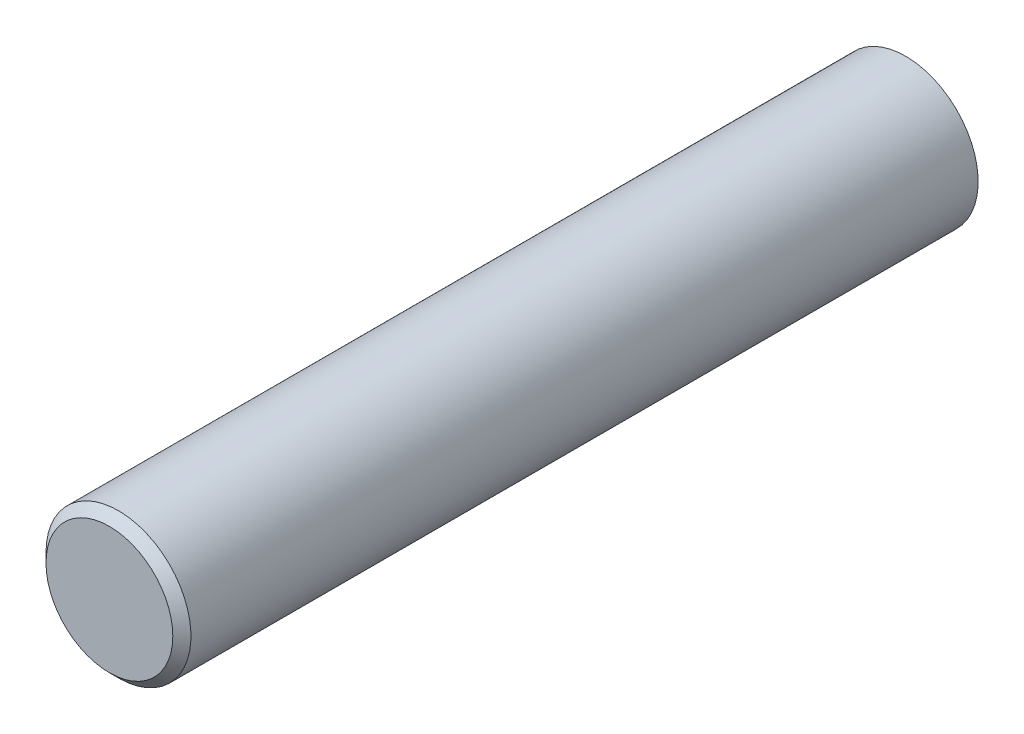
ISO-10303-21;
HEADER;
FILE_DESCRIPTION(('STEP AP214'),'2;1');
FILE_NAME('part.step','',(''),(''),'','','');
FILE_SCHEMA(('AUTOMOTIVE_DESIGN { 1 0 10303 214 1 1 1 1 }'));
ENDSEC;
DATA;
#1=APPLICATION_CONTEXT('core data for automotive mechanical design processes');
#2=APPLICATION_PROTOCOL_DEFINITION('international standard','automotive_design',2000,#1);
#3=PRODUCT_CONTEXT('',#1,'mechanical');
#4=PRODUCT('Part','Part','',(#3));
#5=PRODUCT_RELATED_PRODUCT_CATEGORY('part','',(#4));
#6=PRODUCT_DEFINITION_FORMATION('','',#4);
#7=PRODUCT_DEFINITION_CONTEXT('part definition',#1,'design');
#8=PRODUCT_DEFINITION('design','',#6,#7);
#9=PRODUCT_DEFINITION_SHAPE('','',#8);
#10=(LENGTH_UNIT() NAMED_UNIT(*) SI_UNIT(.MILLI.,.METRE.));
#11=(NAMED_UNIT(*) PLANE_ANGLE_UNIT() SI_UNIT($,.RADIAN.));
#12=(NAMED_UNIT(*) SI_UNIT($,.STERADIAN.) SOLID_ANGLE_UNIT());
#13=UNCERTAINTY_MEASURE_WITH_UNIT(LENGTH_MEASURE(1.E-05),#10,'distance_accuracy_value','');
#14=(GEOMETRIC_REPRESENTATION_CONTEXT(3) GLOBAL_UNCERTAINTY_ASSIGNED_CONTEXT((#13)) GLOBAL_UNIT_ASSIGNED_CONTEXT((#10,
#11,#12)) REPRESENTATION_CONTEXT('',''));
#15=CARTESIAN_POINT('',(0.,0.,0.));
#16=DIRECTION('',(0.,0.,1.));
#17=DIRECTION('',(1.,0.,0.));
#18=AXIS2_PLACEMENT_3D('',#15,#16,#17);
#19=CARTESIAN_POINT('',(0.,0.,90.));
#20=DIRECTION('',(0.,0.,-1.));
#21=DIRECTION('',(-1.,0.,0.));
#22=AXIS2_PLACEMENT_3D('',#19,#20,#21);
#23=CYLINDRICAL_SURFACE('',#22,8.);
#24=CARTESIAN_POINT('',(0.,0.,89.));
#25=DIRECTION('',(0.,0.,1.));
#26=DIRECTION('',(1.,0.,0.));
#27=AXIS2_PLACEMENT_3D('',#24,#25,#26);
#28=CIRCLE('',#27,8.);
#29=CARTESIAN_POINT('',(-8.,0.,89.));
#30=VERTEX_POINT('',#29);
#31=EDGE_CURVE('E10',#30,#30,#28,.F.);
#32=CARTESIAN_POINT('',(0.,0.,2.08633764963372));
#33=DIRECTION('',(0.,0.,-1.));
#34=DIRECTION('',(-1.,0.,0.));
#35=AXIS2_PLACEMENT_3D('',#32,#33,#34);
#36=CIRCLE('',#35,8.);
#37=CARTESIAN_POINT('',(-8.,0.,2.08633764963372));
#38=VERTEX_POINT('',#37);
#39=EDGE_CURVE('E42',#38,#38,#36,.T.);
#40=CARTESIAN_POINT('',(-8.,0.,89.));
#41=CARTESIAN_POINT('',(-8.,0.,88.094649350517));
#42=CARTESIAN_POINT('',(-8.,0.,87.189298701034));
#43=CARTESIAN_POINT('',(-8.,0.,85.3785974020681));
#44=CARTESIAN_POINT('',(-8.,0.,84.4732467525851));
#45=CARTESIAN_POINT('',(-8.,0.,82.6625454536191));
#46=CARTESIAN_POINT('',(-8.,0.,81.7571948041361));
#47=CARTESIAN_POINT('',(-8.,0.,79.9464935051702));
#48=CARTESIAN_POINT('',(-8.,0.,79.0411428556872));
#49=CARTESIAN_POINT('',(-8.,0.,77.2304415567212));
#50=CARTESIAN_POINT('',(-8.,0.,76.3250909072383));
#51=CARTESIAN_POINT('',(-8.,0.,74.5143896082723));
#52=CARTESIAN_POINT('',(-8.,0.,73.6090389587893));
#53=CARTESIAN_POINT('',(-8.,0.,71.7983376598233));
#54=CARTESIAN_POINT('',(-8.,0.,70.8929870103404));
#55=CARTESIAN_POINT('',(-8.,0.,69.0822857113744));
#56=CARTESIAN_POINT('',(-8.,0.,68.1769350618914));
#57=CARTESIAN_POINT('',(-8.,0.,66.3662337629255));
#58=CARTESIAN_POINT('',(-8.,0.,65.4608831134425));
#59=CARTESIAN_POINT('',(-8.,0.,63.6501818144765));
#60=CARTESIAN_POINT('',(-8.,0.,62.7448311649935));
#61=CARTESIAN_POINT('',(-8.,0.,60.9341298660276));
#62=CARTESIAN_POINT('',(-8.,0.,60.0287792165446));
#63=CARTESIAN_POINT('',(-8.,0.,58.2180779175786));
#64=CARTESIAN_POINT('',(-8.,0.,57.3127272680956));
#65=CARTESIAN_POINT('',(-8.,0.,55.5020259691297));
#66=CARTESIAN_POINT('',(-8.,0.,54.5966753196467));
#67=CARTESIAN_POINT('',(-8.,0.,52.7859740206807));
#68=CARTESIAN_POINT('',(-8.,0.,51.8806233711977));
#69=CARTESIAN_POINT('',(-8.,0.,50.0699220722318));
#70=CARTESIAN_POINT('',(-8.,0.,49.1645714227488));
#71=CARTESIAN_POINT('',(-8.,0.,47.3538701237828));
#72=CARTESIAN_POINT('',(-8.,0.,46.4485194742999));
#73=CARTESIAN_POINT('',(-8.,0.,44.6378181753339));
#74=CARTESIAN_POINT('',(-8.,0.,43.7324675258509));
#75=CARTESIAN_POINT('',(-8.,0.,41.9217662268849));
#76=CARTESIAN_POINT('',(-8.,0.,41.016415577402));
#77=CARTESIAN_POINT('',(-8.,0.,39.205714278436));
#78=CARTESIAN_POINT('',(-8.,0.,38.300363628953));
#79=CARTESIAN_POINT('',(-8.,0.,36.489662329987));
#80=CARTESIAN_POINT('',(-8.,0.,35.5843116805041));
#81=CARTESIAN_POINT('',(-8.,0.,33.7736103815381));
#82=CARTESIAN_POINT('',(-8.,0.,32.8682597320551));
#83=CARTESIAN_POINT('',(-8.,0.,31.0575584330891));
#84=CARTESIAN_POINT('',(-8.,0.,30.1522077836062));
#85=CARTESIAN_POINT('',(-8.,0.,28.3415064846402));
#86=CARTESIAN_POINT('',(-8.,0.,27.4361558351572));
#87=CARTESIAN_POINT('',(-8.,0.,25.6254545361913));
#88=CARTESIAN_POINT('',(-8.,0.,24.7201038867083));
#89=CARTESIAN_POINT('',(-8.,0.,22.9094025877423));
#90=CARTESIAN_POINT('',(-8.,0.,22.0040519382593));
#91=CARTESIAN_POINT('',(-8.,0.,20.1933506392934));
#92=CARTESIAN_POINT('',(-8.,0.,19.2879999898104));
#93=CARTESIAN_POINT('',(-8.,0.,17.4772986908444));
#94=CARTESIAN_POINT('',(-8.,0.,16.5719480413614));
#95=CARTESIAN_POINT('',(-8.,0.,14.7612467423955));
#96=CARTESIAN_POINT('',(-8.,0.,13.8558960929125));
#97=CARTESIAN_POINT('',(-8.,0.,12.0451947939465));
#98=CARTESIAN_POINT('',(-8.,0.,11.1398441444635));
#99=CARTESIAN_POINT('',(-8.,0.,9.32914284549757));
#100=CARTESIAN_POINT('',(-8.,0.,8.42379219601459));
#101=CARTESIAN_POINT('',(-8.,0.,6.61309089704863));
#102=CARTESIAN_POINT('',(-8.,0.,5.70774024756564));
#103=CARTESIAN_POINT('',(-8.,0.,3.89703894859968));
#104=CARTESIAN_POINT('',(-8.,0.,2.9916882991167));
#105=CARTESIAN_POINT('',(-8.,0.,2.08633764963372));
#106=B_SPLINE_CURVE_WITH_KNOTS('',3,(#40,#41,#42,#43,#44,#45,#46,#47,#48,#49,#50,#51,#52,#53,
#54,#55,#56,#57,#58,#59,#60,#61,#62,#63,#64,#65,#66,#67,#68,#69,#70,#71,#72,#73,#74,#75,#76,#77,
#78,#79,#80,#81,#82,#83,#84,#85,#86,#87,#88,#89,#90,#91,#92,#93,#94,#95,#96,#97,#98,#99,#100,
#101,#102,#103,#104,#105),.UNSPECIFIED.,.F.,.F.,(4,2,2,2,2,2,2,2,2,2,2,2,2,2,2,2,2,2,2,2,2,2,2,
2,2,2,2,2,2,2,2,2,4),(0.,2.71605194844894,5.43210389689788,8.14815584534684,10.8642077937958,
13.5802597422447,16.2963116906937,19.0123636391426,21.7284155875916,24.4444675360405,
27.1605194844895,29.8765714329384,32.5926233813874,35.3086753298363,38.0247272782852,
40.7407792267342,43.4568311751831,46.1728831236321,48.888935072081,51.60498702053,
54.3210389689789,57.0370909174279,59.7531428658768,62.4691948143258,65.1852467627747,
67.9012987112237,70.6173506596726,73.3334026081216,76.0494545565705,78.7655065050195,
81.4815584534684,84.1976104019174,86.9136623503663),.UNSPECIFIED.);
#107=EDGE_CURVE('BSEAM31',#30,#38,#106,.T.);
#108=ORIENTED_EDGE('',*,*,#31,.T.);
#109=ORIENTED_EDGE('',*,*,#39,.F.);
#110=ORIENTED_EDGE('',*,*,#107,.T.);
#111=ORIENTED_EDGE('',*,*,#107,.F.);
#112=EDGE_LOOP('',(#108,#110,#109,#111));
#113=FACE_BOUND('',#112,.T.);
#114=ADVANCED_FACE('F31',(#113),#23,.T.);
#115=CARTESIAN_POINT('',(0.,0.,90.));
#116=DIRECTION('',(0.,0.,1.));
#117=DIRECTION('',(1.,0.,0.));
#118=AXIS2_PLACEMENT_3D('',#115,#116,#117);
#119=PLANE('',#118);
#120=CARTESIAN_POINT('',(0.,0.,90.));
#121=DIRECTION('',(0.,0.,1.));
#122=DIRECTION('',(1.,0.,0.));
#123=AXIS2_PLACEMENT_3D('',#120,#121,#122);
#124=CIRCLE('',#123,7.00000000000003);
#125=CARTESIAN_POINT('',(7.00000000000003,0.,90.));
#126=VERTEX_POINT('',#125);
#127=EDGE_CURVE('E38',#126,#126,#124,.T.);
#128=ORIENTED_EDGE('',*,*,#127,.T.);
#129=EDGE_LOOP('',(#128));
#130=FACE_BOUND('',#129,.T.);
#131=ADVANCED_FACE('F57',(#130),#119,.T.);
#132=CARTESIAN_POINT('',(0.,0.,16.));
#133=DIRECTION('',(0.,0.,-1.));
#134=DIRECTION('',(-1.,0.,0.));
#135=AXIS2_PLACEMENT_3D('',#132,#133,#134);
#136=DEGENERATE_TOROIDAL_SURFACE('',#135,0.1,16.,.T.);
#137=CARTESIAN_POINT('',(0.,0.,0.));
#138=DIRECTION('',(0.,0.,-1.));
#139=DIRECTION('',(-1.,0.,0.));
#140=AXIS2_PLACEMENT_3D('',#137,#138,#139);
#141=CIRCLE('',#140,0.1);
#142=CARTESIAN_POINT('',(-0.1,0.,0.));
#143=VERTEX_POINT('',#142);
#144=EDGE_CURVE('E46',#143,#143,#141,.T.);
#145=ORIENTED_EDGE('',*,*,#144,.F.);
#146=EDGE_LOOP('',(#145));
#147=FACE_BOUND('',#146,.T.);
#148=ORIENTED_EDGE('',*,*,#39,.T.);
#149=EDGE_LOOP('',(#148));
#150=FACE_BOUND('',#149,.T.);
#151=ADVANCED_FACE('F54',(#147,#150),#136,.T.);
#152=CARTESIAN_POINT('',(0.,0.,0.));
#153=DIRECTION('',(0.,0.,1.));
#154=DIRECTION('',(1.,0.,0.));
#155=AXIS2_PLACEMENT_3D('',#152,#153,#154);
#156=PLANE('',#155);
#157=ORIENTED_EDGE('',*,*,#144,.T.);
#158=EDGE_LOOP('',(#157));
#159=FACE_BOUND('',#158,.T.);
#160=ADVANCED_FACE('F52',(#159),#156,.F.);
#161=CARTESIAN_POINT('',(0.,0.,90.));
#162=DIRECTION('',(0.,0.,-1.));
#163=DIRECTION('',(-1.,0.,0.));
#164=AXIS2_PLACEMENT_3D('',#161,#162,#163);
#165=CONICAL_SURFACE('',#164,7.00000000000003,0.785398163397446);
#166=ORIENTED_EDGE('',*,*,#31,.F.);
#167=EDGE_LOOP('',(#166));
#168=FACE_BOUND('',#167,.T.);
#169=ORIENTED_EDGE('',*,*,#127,.F.);
#170=EDGE_LOOP('',(#169));
#171=FACE_BOUND('',#170,.T.);
#172=ADVANCED_FACE('F33',(#168,#171),#165,.T.);
#173=CLOSED_SHELL('',(#114,#131,#151,#160,#172));
#174=MANIFOLD_SOLID_BREP('B2',#173);
#175=ADVANCED_BREP_SHAPE_REPRESENTATION('',(#18,#174),#14);
#176=SHAPE_DEFINITION_REPRESENTATION(#9,#175);
ENDSEC;
END-ISO-10303-21;
